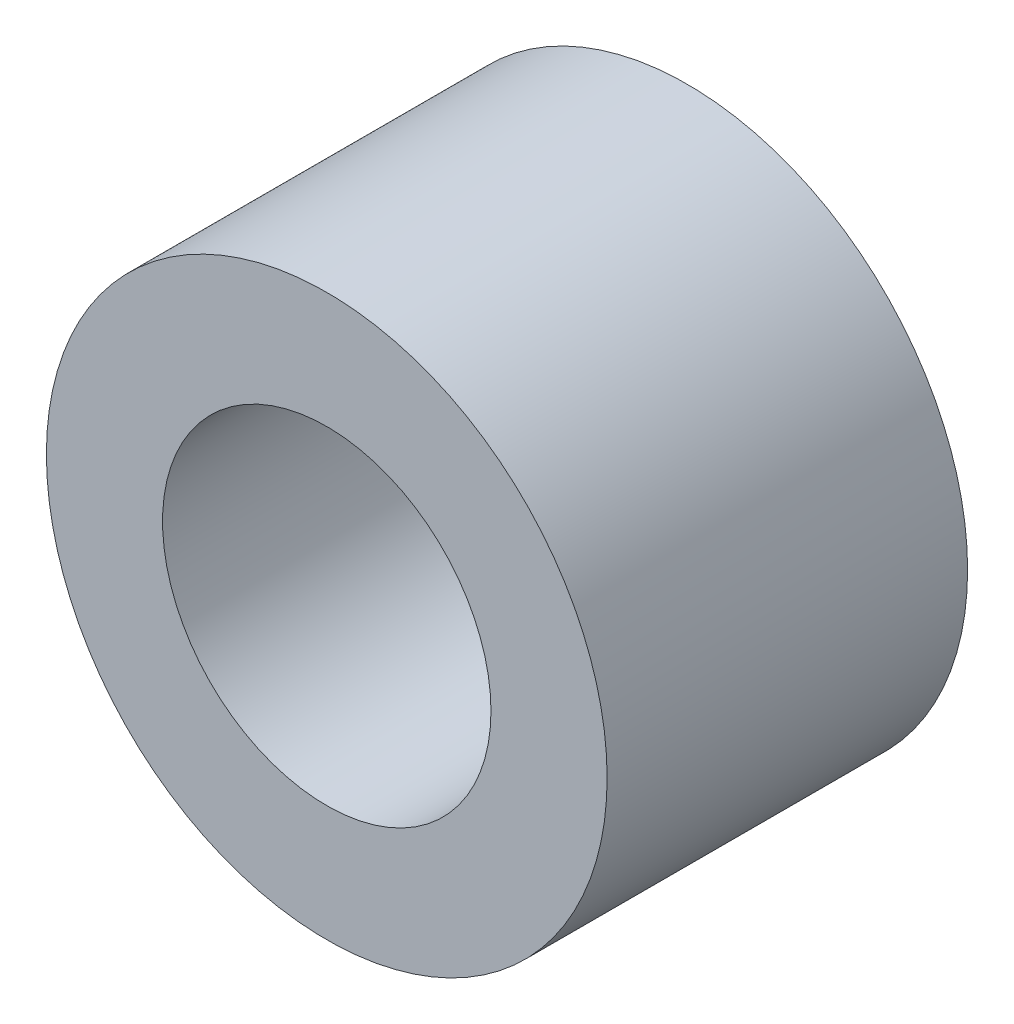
from build123d import *

# Parameters (mm, degrees)
SKETCH1_R           = 4.1
BOSS_EXTRUDE1_DEPTH = 9
BOSS_EXTRUDE2_START = -9
SKETCH4_R           = 7
SKETCH4_R_2         = 5.309379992
BOSS_EXTRUDE2_DEPTH = 9


with BuildPart() as part:
    # Sketch1 → Boss-Extrude1 (new body)
    with BuildSketch(Plane.XY):
        with BuildLine():
            ThreePointArc((141.355009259, 81.209218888), (142.707052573, 88.595084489), (135.321186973, 89.947127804))
            ThreePointArc((135.321186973, 89.947127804), (133.969143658, 82.561262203), (141.355009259, 81.209218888))
        make_face()
        with Locations((138.338098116, 85.578173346)):
            Circle(SKETCH1_R, mode=Mode.SUBTRACT)
    extrude(amount=BOSS_EXTRUDE1_DEPTH)

    # Sketch4 → Boss-Extrude2 (add)
    with BuildSketch(Plane.XY.offset(9).offset(BOSS_EXTRUDE2_START)):
        with Locations((138.338098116, 85.578173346)):
            Circle(SKETCH4_R)
        with Locations((138.338098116, 85.578173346)):
            Circle(SKETCH4_R_2, mode=Mode.SUBTRACT)
    extrude(amount=BOSS_EXTRUDE2_DEPTH)


solid = part.part
